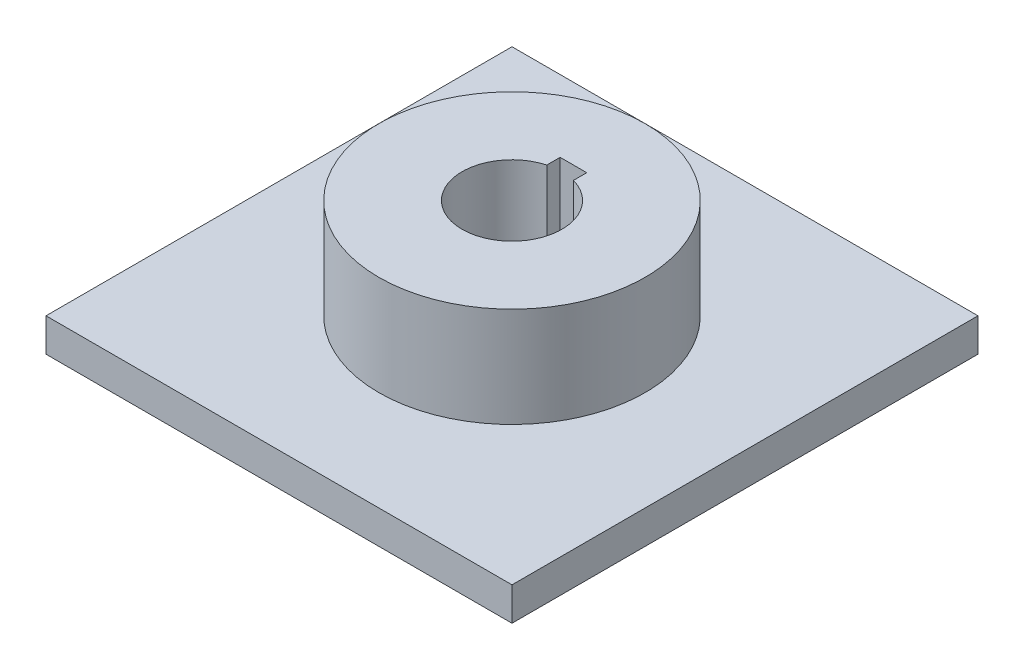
from build123d import *

# Parameters (mm, degrees)
SKETCH9_W           = 70
SKETCH9_H           = 70
BOSS_EXTRUDE5_DEPTH = 5
SKETCH10_R          = 20
BOSS_EXTRUDE6_DEPTH = 15


with BuildPart() as part:
    # Sketch9 → Boss-Extrude5 (new body)
    with BuildSketch(Plane(origin=(0, 0, 0), x_dir=(1, 0, 0), z_dir=(0, 1, 0))):
        Rectangle(SKETCH9_W, SKETCH9_H)
    extrude(amount=BOSS_EXTRUDE5_DEPTH)

    # Sketch10 → Boss-Extrude6 (add)
    with BuildSketch(Plane(origin=(0, 5, 0), x_dir=(1, 0, 0), z_dir=(0, 1, 0))):
        with Locations(Location((0, 0, 0), (0, 0, 270))):
            Circle(SKETCH10_R)
        with BuildLine():
            Line((-2, 7.228416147), (-2, 9.228416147))
            Line((-2, 9.228416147), (2, 9.228416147))
            Line((2, 9.228416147), (2, 7.228416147))
            ThreePointArc((2, 7.228416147), (0, -7.5), (-2, 7.228416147))
        make_face(mode=Mode.SUBTRACT)
    extrude(amount=BOSS_EXTRUDE6_DEPTH)


solid = part.part
